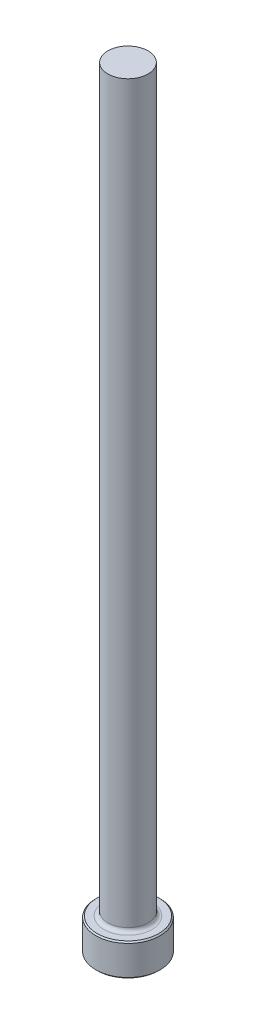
ISO-10303-21;
HEADER;
FILE_DESCRIPTION(('STEP AP214'),'2;1');
FILE_NAME('part.step','',(''),(''),'','','');
FILE_SCHEMA(('AUTOMOTIVE_DESIGN { 1 0 10303 214 1 1 1 1 }'));
ENDSEC;
DATA;
#1=APPLICATION_CONTEXT('core data for automotive mechanical design processes');
#2=APPLICATION_PROTOCOL_DEFINITION('international standard','automotive_design',2000,#1);
#3=PRODUCT_CONTEXT('',#1,'mechanical');
#4=PRODUCT('Part','Part','',(#3));
#5=PRODUCT_RELATED_PRODUCT_CATEGORY('part','',(#4));
#6=PRODUCT_DEFINITION_FORMATION('','',#4);
#7=PRODUCT_DEFINITION_CONTEXT('part definition',#1,'design');
#8=PRODUCT_DEFINITION('design','',#6,#7);
#9=PRODUCT_DEFINITION_SHAPE('','',#8);
#10=(LENGTH_UNIT() NAMED_UNIT(*) SI_UNIT(.MILLI.,.METRE.));
#11=(NAMED_UNIT(*) PLANE_ANGLE_UNIT() SI_UNIT($,.RADIAN.));
#12=(NAMED_UNIT(*) SI_UNIT($,.STERADIAN.) SOLID_ANGLE_UNIT());
#13=UNCERTAINTY_MEASURE_WITH_UNIT(LENGTH_MEASURE(1.E-05),#10,'distance_accuracy_value','');
#14=(GEOMETRIC_REPRESENTATION_CONTEXT(3) GLOBAL_UNCERTAINTY_ASSIGNED_CONTEXT((#13)) GLOBAL_UNIT_ASSIGNED_CONTEXT((#10,
#11,#12)) REPRESENTATION_CONTEXT('',''));
#15=CARTESIAN_POINT('',(0.,0.,0.));
#16=DIRECTION('',(0.,0.,1.));
#17=DIRECTION('',(1.,0.,0.));
#18=AXIS2_PLACEMENT_3D('',#15,#16,#17);
#19=CARTESIAN_POINT('',(0.,0.,0.));
#20=DIRECTION('',(0.,-1.,0.));
#21=DIRECTION('',(0.,0.,-1.));
#22=AXIS2_PLACEMENT_3D('',#19,#20,#21);
#23=PLANE('',#22);
#24=CARTESIAN_POINT('',(0.,0.,0.));
#25=DIRECTION('',(0.,-1.,0.));
#26=DIRECTION('',(0.,0.,-1.));
#27=AXIS2_PLACEMENT_3D('',#24,#25,#26);
#28=CIRCLE('',#27,6.09599999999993);
#29=CARTESIAN_POINT('',(0.,0.,-6.09599999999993));
#30=VERTEX_POINT('',#29);
#31=EDGE_CURVE('E46',#30,#30,#28,.T.);
#32=ORIENTED_EDGE('',*,*,#31,.T.);
#33=EDGE_LOOP('',(#32));
#34=FACE_BOUND('',#33,.T.);
#35=ADVANCED_FACE('F35',(#34),#23,.T.);
#36=CARTESIAN_POINT('',(0.,259.958771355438,0.));
#37=DIRECTION('',(0.,1.,0.));
#38=DIRECTION('',(0.,0.,1.));
#39=AXIS2_PLACEMENT_3D('',#36,#37,#38);
#40=CYLINDRICAL_SURFACE('',#39,6.34999999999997);
#41=CARTESIAN_POINT('',(0.,6.09600000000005,0.));
#42=DIRECTION('',(0.,1.,0.));
#43=DIRECTION('',(0.,0.,1.));
#44=AXIS2_PLACEMENT_3D('',#41,#42,#43);
#45=CIRCLE('',#44,6.34999999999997);
#46=CARTESIAN_POINT('',(0.,6.09600000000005,6.34999999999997));
#47=VERTEX_POINT('',#46);
#48=EDGE_CURVE('E50',#47,#47,#45,.F.);
#49=ORIENTED_EDGE('',*,*,#48,.T.);
#50=EDGE_LOOP('',(#49));
#51=FACE_BOUND('',#50,.T.);
#52=CARTESIAN_POINT('',(0.,0.254000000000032,0.));
#53=DIRECTION('',(0.,-1.,0.));
#54=DIRECTION('',(0.,0.,-1.));
#55=AXIS2_PLACEMENT_3D('',#52,#53,#54);
#56=CIRCLE('',#55,6.34999999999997);
#57=CARTESIAN_POINT('',(0.,0.254000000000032,-6.34999999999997));
#58=VERTEX_POINT('',#57);
#59=EDGE_CURVE('E55',#58,#58,#56,.F.);
#60=ORIENTED_EDGE('',*,*,#59,.T.);
#61=EDGE_LOOP('',(#60));
#62=FACE_BOUND('',#61,.T.);
#63=ADVANCED_FACE('F77',(#51,#62),#40,.T.);
#64=CARTESIAN_POINT('',(-6.34999999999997,6.35,0.));
#65=DIRECTION('',(0.,1.,0.));
#66=DIRECTION('',(0.,0.,1.));
#67=AXIS2_PLACEMENT_3D('',#64,#65,#66);
#68=PLANE('',#67);
#69=CARTESIAN_POINT('',(0.,6.35,0.));
#70=DIRECTION('',(0.,1.,0.));
#71=DIRECTION('',(0.,0.,1.));
#72=AXIS2_PLACEMENT_3D('',#69,#70,#71);
#73=CIRCLE('',#72,4.73074999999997);
#74=CARTESIAN_POINT('',(0.,6.35,4.73074999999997));
#75=VERTEX_POINT('',#74);
#76=EDGE_CURVE('E10',#75,#75,#73,.F.);
#77=ORIENTED_EDGE('',*,*,#76,.T.);
#78=EDGE_LOOP('',(#77));
#79=FACE_BOUND('',#78,.T.);
#80=CARTESIAN_POINT('',(0.,6.35,0.));
#81=DIRECTION('',(0.,1.,0.));
#82=DIRECTION('',(0.,0.,1.));
#83=AXIS2_PLACEMENT_3D('',#80,#81,#82);
#84=CIRCLE('',#83,6.09600000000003);
#85=CARTESIAN_POINT('',(0.,6.35,6.09600000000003));
#86=VERTEX_POINT('',#85);
#87=EDGE_CURVE('E58',#86,#86,#84,.T.);
#88=ORIENTED_EDGE('',*,*,#87,.T.);
#89=EDGE_LOOP('',(#88));
#90=FACE_BOUND('',#89,.T.);
#91=ADVANCED_FACE('F69',(#79,#90),#68,.T.);
#92=CARTESIAN_POINT('',(0.,259.958771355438,0.));
#93=DIRECTION('',(0.,1.,0.));
#94=DIRECTION('',(0.,0.,1.));
#95=AXIS2_PLACEMENT_3D('',#92,#93,#94);
#96=CYLINDRICAL_SURFACE('',#95,3.96874999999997);
#97=CARTESIAN_POINT('',(0.,7.11200000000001,0.));
#98=DIRECTION('',(0.,1.,0.));
#99=DIRECTION('',(0.,0.,1.));
#100=AXIS2_PLACEMENT_3D('',#97,#98,#99);
#101=CIRCLE('',#100,3.96874999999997);
#102=CARTESIAN_POINT('',(0.,7.11200000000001,3.96874999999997));
#103=VERTEX_POINT('',#102);
#104=EDGE_CURVE('E42',#103,#103,#101,.T.);
#105=ORIENTED_EDGE('',*,*,#104,.T.);
#106=EDGE_LOOP('',(#105));
#107=FACE_BOUND('',#106,.T.);
#108=CARTESIAN_POINT('',(0.,152.4,0.));
#109=DIRECTION('',(0.,1.,0.));
#110=DIRECTION('',(0.,0.,1.));
#111=AXIS2_PLACEMENT_3D('',#108,#109,#110);
#112=CIRCLE('',#111,3.96874999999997);
#113=CARTESIAN_POINT('',(0.,152.4,3.96874999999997));
#114=VERTEX_POINT('',#113);
#115=EDGE_CURVE('E61',#114,#114,#112,.T.);
#116=ORIENTED_EDGE('',*,*,#115,.F.);
#117=EDGE_LOOP('',(#116));
#118=FACE_BOUND('',#117,.T.);
#119=ADVANCED_FACE('F67',(#107,#118),#96,.T.);
#120=CARTESIAN_POINT('',(-3.96874999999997,152.4,0.));
#121=DIRECTION('',(0.,1.,0.));
#122=DIRECTION('',(0.,0.,1.));
#123=AXIS2_PLACEMENT_3D('',#120,#121,#122);
#124=PLANE('',#123);
#125=ORIENTED_EDGE('',*,*,#115,.T.);
#126=EDGE_LOOP('',(#125));
#127=FACE_BOUND('',#126,.T.);
#128=ADVANCED_FACE('F65',(#127),#124,.T.);
#129=CARTESIAN_POINT('',(0.,6.35000000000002,0.));
#130=DIRECTION('',(0.,-1.,0.));
#131=DIRECTION('',(0.,0.,-1.));
#132=AXIS2_PLACEMENT_3D('',#129,#130,#131);
#133=CONICAL_SURFACE('',#132,6.096,0.785398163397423);
#134=ORIENTED_EDGE('',*,*,#48,.F.);
#135=EDGE_LOOP('',(#134));
#136=FACE_BOUND('',#135,.T.);
#137=ORIENTED_EDGE('',*,*,#87,.F.);
#138=EDGE_LOOP('',(#137));
#139=FACE_BOUND('',#138,.T.);
#140=ADVANCED_FACE('F75',(#136,#139),#133,.T.);
#141=CARTESIAN_POINT('',(0.,0.254000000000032,0.));
#142=DIRECTION('',(0.,1.,0.));
#143=DIRECTION('',(0.,0.,1.));
#144=AXIS2_PLACEMENT_3D('',#141,#142,#143);
#145=CONICAL_SURFACE('',#144,6.34999999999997,0.78539816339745);
#146=ORIENTED_EDGE('',*,*,#31,.F.);
#147=EDGE_LOOP('',(#146));
#148=FACE_BOUND('',#147,.T.);
#149=ORIENTED_EDGE('',*,*,#59,.F.);
#150=EDGE_LOOP('',(#149));
#151=FACE_BOUND('',#150,.T.);
#152=ADVANCED_FACE('F89',(#148,#151),#145,.T.);
#153=CARTESIAN_POINT('',(0.,7.11200000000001,0.));
#154=DIRECTION('',(0.,1.,0.));
#155=DIRECTION('',(0.,0.,1.));
#156=AXIS2_PLACEMENT_3D('',#153,#154,#155);
#157=TOROIDAL_SURFACE('',#156,4.73074999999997,0.762);
#158=ORIENTED_EDGE('',*,*,#76,.F.);
#159=EDGE_LOOP('',(#158));
#160=FACE_BOUND('',#159,.T.);
#161=ORIENTED_EDGE('',*,*,#104,.F.);
#162=EDGE_LOOP('',(#161));
#163=FACE_BOUND('',#162,.T.);
#164=ADVANCED_FACE('F37',(#160,#163),#157,.F.);
#165=CLOSED_SHELL('',(#35,#63,#91,#119,#128,#140,#152,#164));
#166=MANIFOLD_SOLID_BREP('B2',#165);
#167=ADVANCED_BREP_SHAPE_REPRESENTATION('',(#18,#166),#14);
#168=SHAPE_DEFINITION_REPRESENTATION(#9,#167);
ENDSEC;
END-ISO-10303-21;
